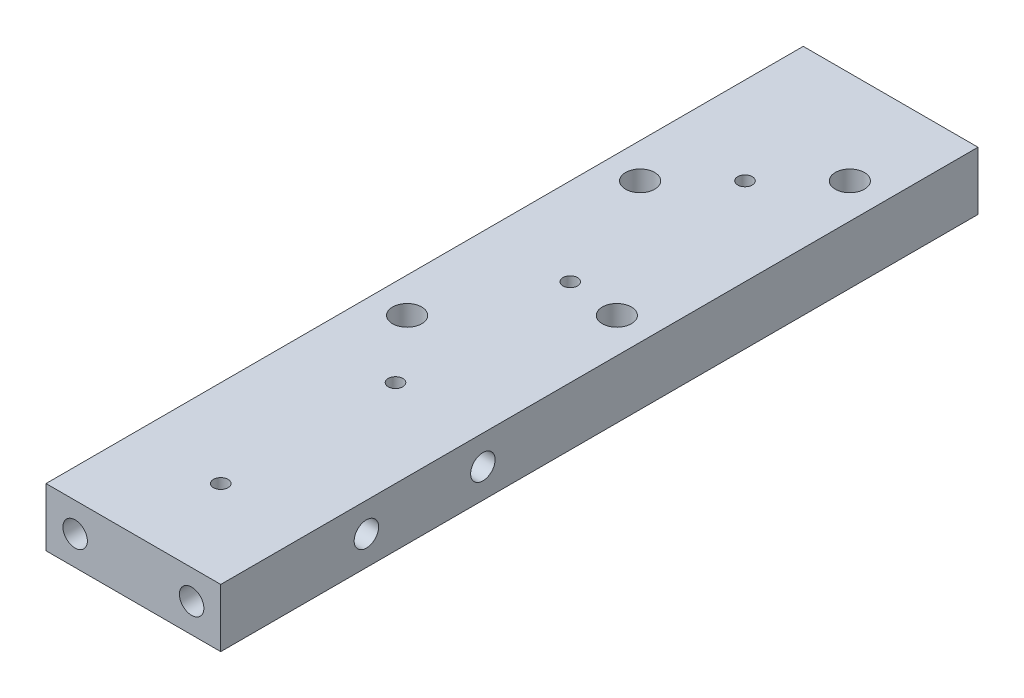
ISO-10303-21;
HEADER;
FILE_DESCRIPTION(('STEP AP214'),'2;1');
FILE_NAME('part.step','',(''),(''),'','','');
FILE_SCHEMA(('AUTOMOTIVE_DESIGN { 1 0 10303 214 1 1 1 1 }'));
ENDSEC;
DATA;
#1=APPLICATION_CONTEXT('core data for automotive mechanical design processes');
#2=APPLICATION_PROTOCOL_DEFINITION('international standard','automotive_design',2000,#1);
#3=PRODUCT_CONTEXT('',#1,'mechanical');
#4=PRODUCT('Part','Part','',(#3));
#5=PRODUCT_RELATED_PRODUCT_CATEGORY('part','',(#4));
#6=PRODUCT_DEFINITION_FORMATION('','',#4);
#7=PRODUCT_DEFINITION_CONTEXT('part definition',#1,'design');
#8=PRODUCT_DEFINITION('design','',#6,#7);
#9=PRODUCT_DEFINITION_SHAPE('','',#8);
#10=(LENGTH_UNIT() NAMED_UNIT(*) SI_UNIT(.MILLI.,.METRE.));
#11=(NAMED_UNIT(*) PLANE_ANGLE_UNIT() SI_UNIT($,.RADIAN.));
#12=(NAMED_UNIT(*) SI_UNIT($,.STERADIAN.) SOLID_ANGLE_UNIT());
#13=UNCERTAINTY_MEASURE_WITH_UNIT(LENGTH_MEASURE(1.E-05),#10,'distance_accuracy_value','');
#14=(GEOMETRIC_REPRESENTATION_CONTEXT(3) GLOBAL_UNCERTAINTY_ASSIGNED_CONTEXT((#13)) GLOBAL_UNIT_ASSIGNED_CONTEXT((#10,
#11,#12)) REPRESENTATION_CONTEXT('',''));
#15=CARTESIAN_POINT('',(0.,0.,0.));
#16=DIRECTION('',(0.,0.,1.));
#17=DIRECTION('',(1.,0.,0.));
#18=AXIS2_PLACEMENT_3D('',#15,#16,#17);
#19=CARTESIAN_POINT('',(2.59999999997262,5.,40.));
#20=DIRECTION('',(1.,0.,0.));
#21=DIRECTION('',(0.,0.,-1.));
#22=AXIS2_PLACEMENT_3D('',#19,#20,#21);
#23=CONICAL_SURFACE('',#22,2.10000000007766,1.02974425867);
#24=CARTESIAN_POINT('',(1.33819269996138,5.,40.));
#25=VERTEX_POINT('',#24);
#26=VERTEX_LOOP('',#25);
#27=FACE_BOUND('',#26,.T.);
#28=CARTESIAN_POINT('',(2.60000000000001,5.,40.));
#29=DIRECTION('',(1.,0.,0.));
#30=DIRECTION('',(0.,0.,-1.));
#31=AXIS2_PLACEMENT_3D('',#28,#29,#30);
#32=CIRCLE('',#31,2.1);
#33=CARTESIAN_POINT('',(2.60000000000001,5.,37.9));
#34=VERTEX_POINT('',#33);
#35=EDGE_CURVE('E84',#34,#34,#32,.T.);
#36=ORIENTED_EDGE('',*,*,#35,.T.);
#37=EDGE_LOOP('',(#36));
#38=FACE_BOUND('',#37,.T.);
#39=ADVANCED_FACE('F17',(#27,#38),#23,.F.);
#40=CARTESIAN_POINT('',(2.59999999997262,5.,20.));
#41=DIRECTION('',(1.,0.,0.));
#42=DIRECTION('',(0.,0.,-1.));
#43=AXIS2_PLACEMENT_3D('',#40,#41,#42);
#44=CONICAL_SURFACE('',#43,2.10000000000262,1.0297442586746);
#45=CARTESIAN_POINT('',(1.33819270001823,5.,20.));
#46=VERTEX_POINT('',#45);
#47=VERTEX_LOOP('',#46);
#48=FACE_BOUND('',#47,.T.);
#49=CARTESIAN_POINT('',(2.6,5.,20.));
#50=DIRECTION('',(1.,0.,0.));
#51=DIRECTION('',(0.,0.,-1.));
#52=AXIS2_PLACEMENT_3D('',#49,#50,#51);
#53=CIRCLE('',#52,2.1);
#54=CARTESIAN_POINT('',(2.6,5.,17.9));
#55=VERTEX_POINT('',#54);
#56=EDGE_CURVE('E86',#55,#55,#53,.T.);
#57=ORIENTED_EDGE('',*,*,#56,.T.);
#58=EDGE_LOOP('',(#57));
#59=FACE_BOUND('',#58,.T.);
#60=ADVANCED_FACE('F81',(#48,#59),#44,.F.);
#61=CARTESIAN_POINT('',(-10.0000000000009,5.,-52.6000000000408));
#62=DIRECTION('',(0.,0.,-1.));
#63=DIRECTION('',(-1.,0.,0.));
#64=AXIS2_PLACEMENT_3D('',#61,#62,#63);
#65=CONICAL_SURFACE('',#64,2.09999999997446,1.0297442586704);
#66=CARTESIAN_POINT('',(-10.0000000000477,5.,-51.3381927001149));
#67=VERTEX_POINT('',#66);
#68=VERTEX_LOOP('',#67);
#69=FACE_BOUND('',#68,.T.);
#70=CARTESIAN_POINT('',(-10.0000000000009,5.,-52.6));
#71=DIRECTION('',(0.,0.,-1.));
#72=DIRECTION('',(-1.,0.,0.));
#73=AXIS2_PLACEMENT_3D('',#70,#71,#72);
#74=CIRCLE('',#73,2.1);
#75=CARTESIAN_POINT('',(-12.1000000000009,5.,-52.6));
#76=VERTEX_POINT('',#75);
#77=EDGE_CURVE('E89',#76,#76,#74,.T.);
#78=ORIENTED_EDGE('',*,*,#77,.T.);
#79=EDGE_LOOP('',(#78));
#80=FACE_BOUND('',#79,.T.);
#81=ADVANCED_FACE('F193',(#69,#80),#65,.F.);
#82=CARTESIAN_POINT('',(9.99999999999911,5.,-52.6000000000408));
#83=DIRECTION('',(0.,0.,-1.));
#84=DIRECTION('',(-1.,0.,0.));
#85=AXIS2_PLACEMENT_3D('',#82,#83,#84);
#86=CONICAL_SURFACE('',#85,2.09999999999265,1.0297442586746);
#87=CARTESIAN_POINT('',(9.99999999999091,5.,-51.3381927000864));
#88=VERTEX_POINT('',#87);
#89=VERTEX_LOOP('',#88);
#90=FACE_BOUND('',#89,.T.);
#91=CARTESIAN_POINT('',(9.99999999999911,5.,-52.6));
#92=DIRECTION('',(0.,0.,-1.));
#93=DIRECTION('',(-1.,0.,0.));
#94=AXIS2_PLACEMENT_3D('',#91,#92,#93);
#95=CIRCLE('',#94,2.1);
#96=CARTESIAN_POINT('',(7.89999999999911,5.,-52.6));
#97=VERTEX_POINT('',#96);
#98=EDGE_CURVE('E188',#97,#97,#95,.T.);
#99=ORIENTED_EDGE('',*,*,#98,.T.);
#100=EDGE_LOOP('',(#99));
#101=FACE_BOUND('',#100,.T.);
#102=ADVANCED_FACE('F528',(#90,#101),#86,.F.);
#103=CARTESIAN_POINT('',(-2.59999999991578,5.,40.));
#104=DIRECTION('',(-1.,0.,0.));
#105=DIRECTION('',(0.,0.,1.));
#106=AXIS2_PLACEMENT_3D('',#103,#104,#105);
#107=CONICAL_SURFACE('',#106,2.09999999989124,1.02974425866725);
#108=CARTESIAN_POINT('',(-1.33819270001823,5.,40.));
#109=VERTEX_POINT('',#108);
#110=VERTEX_LOOP('',#109);
#111=FACE_BOUND('',#110,.T.);
#112=CARTESIAN_POINT('',(-2.60000000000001,5.,40.));
#113=DIRECTION('',(-1.,0.,0.));
#114=DIRECTION('',(0.,0.,1.));
#115=AXIS2_PLACEMENT_3D('',#112,#113,#114);
#116=CIRCLE('',#115,2.1);
#117=CARTESIAN_POINT('',(-2.60000000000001,5.,42.1));
#118=VERTEX_POINT('',#117);
#119=EDGE_CURVE('E185',#118,#118,#116,.T.);
#120=ORIENTED_EDGE('',*,*,#119,.T.);
#121=EDGE_LOOP('',(#120));
#122=FACE_BOUND('',#121,.T.);
#123=ADVANCED_FACE('F519',(#111,#122),#107,.F.);
#124=CARTESIAN_POINT('',(-2.59999999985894,5.,20.));
#125=DIRECTION('',(-1.,0.,0.));
#126=DIRECTION('',(0.,0.,1.));
#127=AXIS2_PLACEMENT_3D('',#124,#125,#126);
#128=CONICAL_SURFACE('',#127,2.09999999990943,1.02974425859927);
#129=CARTESIAN_POINT('',(-1.33819269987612,5.,19.9999999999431));
#130=VERTEX_POINT('',#129);
#131=VERTEX_LOOP('',#130);
#132=FACE_BOUND('',#131,.T.);
#133=CARTESIAN_POINT('',(-2.6,5.,20.));
#134=DIRECTION('',(-1.,0.,0.));
#135=DIRECTION('',(0.,0.,1.));
#136=AXIS2_PLACEMENT_3D('',#133,#134,#135);
#137=CIRCLE('',#136,2.1);
#138=CARTESIAN_POINT('',(-2.60000000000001,5.,22.1));
#139=VERTEX_POINT('',#138);
#140=EDGE_CURVE('E178',#139,#139,#137,.T.);
#141=ORIENTED_EDGE('',*,*,#140,.T.);
#142=EDGE_LOOP('',(#141));
#143=FACE_BOUND('',#142,.T.);
#144=ADVANCED_FACE('F510',(#132,#143),#128,.F.);
#145=CARTESIAN_POINT('',(9.99999999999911,5.,52.6000000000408));
#146=DIRECTION('',(0.,0.,1.));
#147=DIRECTION('',(1.,0.,0.));
#148=AXIS2_PLACEMENT_3D('',#145,#146,#147);
#149=CONICAL_SURFACE('',#148,2.09999999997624,1.02974425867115);
#150=CARTESIAN_POINT('',(10.0000000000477,5.,51.3381927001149));
#151=VERTEX_POINT('',#150);
#152=VERTEX_LOOP('',#151);
#153=FACE_BOUND('',#152,.T.);
#154=CARTESIAN_POINT('',(9.99999999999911,5.,52.6));
#155=DIRECTION('',(0.,0.,1.));
#156=DIRECTION('',(1.,0.,0.));
#157=AXIS2_PLACEMENT_3D('',#154,#155,#156);
#158=CIRCLE('',#157,2.1);
#159=CARTESIAN_POINT('',(12.0999999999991,5.,52.6));
#160=VERTEX_POINT('',#159);
#161=EDGE_CURVE('E173',#160,#160,#158,.T.);
#162=ORIENTED_EDGE('',*,*,#161,.T.);
#163=EDGE_LOOP('',(#162));
#164=FACE_BOUND('',#163,.T.);
#165=ADVANCED_FACE('F501',(#153,#164),#149,.F.);
#166=CARTESIAN_POINT('',(-10.0000000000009,5.,52.6000000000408));
#167=DIRECTION('',(0.,0.,1.));
#168=DIRECTION('',(1.,0.,0.));
#169=AXIS2_PLACEMENT_3D('',#166,#167,#168);
#170=CONICAL_SURFACE('',#169,2.09999999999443,1.0297442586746);
#171=CARTESIAN_POINT('',(-9.99999999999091,5.,51.3381927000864));
#172=VERTEX_POINT('',#171);
#173=VERTEX_LOOP('',#172);
#174=FACE_BOUND('',#173,.T.);
#175=CARTESIAN_POINT('',(-10.0000000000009,5.,52.6));
#176=DIRECTION('',(0.,0.,1.));
#177=DIRECTION('',(1.,0.,0.));
#178=AXIS2_PLACEMENT_3D('',#175,#176,#177);
#179=CIRCLE('',#178,2.1);
#180=CARTESIAN_POINT('',(-7.90000000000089,5.,52.6));
#181=VERTEX_POINT('',#180);
#182=EDGE_CURVE('E169',#181,#181,#179,.T.);
#183=ORIENTED_EDGE('',*,*,#182,.T.);
#184=EDGE_LOOP('',(#183));
#185=FACE_BOUND('',#184,.T.);
#186=ADVANCED_FACE('F492',(#174,#185),#170,.F.);
#187=CARTESIAN_POINT('',(15.,5.,40.));
#188=DIRECTION('',(1.,0.,0.));
#189=DIRECTION('',(0.,0.,-1.));
#190=AXIS2_PLACEMENT_3D('',#187,#188,#189);
#191=CYLINDRICAL_SURFACE('',#190,2.1);
#192=ORIENTED_EDGE('',*,*,#35,.F.);
#193=EDGE_LOOP('',(#192));
#194=FACE_BOUND('',#193,.T.);
#195=CARTESIAN_POINT('',(15.,5.,40.));
#196=DIRECTION('',(1.,0.,0.));
#197=DIRECTION('',(0.,0.,-1.));
#198=AXIS2_PLACEMENT_3D('',#195,#196,#197);
#199=CIRCLE('',#198,2.1);
#200=CARTESIAN_POINT('',(15.,5.,37.9));
#201=VERTEX_POINT('',#200);
#202=EDGE_CURVE('E144',#201,#201,#199,.T.);
#203=ORIENTED_EDGE('',*,*,#202,.T.);
#204=EDGE_LOOP('',(#203));
#205=FACE_BOUND('',#204,.T.);
#206=ADVANCED_FACE('F482',(#194,#205),#191,.F.);
#207=CARTESIAN_POINT('',(15.,5.,20.));
#208=DIRECTION('',(1.,0.,0.));
#209=DIRECTION('',(0.,0.,-1.));
#210=AXIS2_PLACEMENT_3D('',#207,#208,#209);
#211=CYLINDRICAL_SURFACE('',#210,2.1);
#212=ORIENTED_EDGE('',*,*,#56,.F.);
#213=EDGE_LOOP('',(#212));
#214=FACE_BOUND('',#213,.T.);
#215=CARTESIAN_POINT('',(15.,5.,20.));
#216=DIRECTION('',(1.,0.,0.));
#217=DIRECTION('',(0.,0.,-1.));
#218=AXIS2_PLACEMENT_3D('',#215,#216,#217);
#219=CIRCLE('',#218,2.1);
#220=CARTESIAN_POINT('',(15.,5.,17.9));
#221=VERTEX_POINT('',#220);
#222=EDGE_CURVE('E140',#221,#221,#219,.T.);
#223=ORIENTED_EDGE('',*,*,#222,.T.);
#224=EDGE_LOOP('',(#223));
#225=FACE_BOUND('',#224,.T.);
#226=ADVANCED_FACE('F199',(#214,#225),#211,.F.);
#227=CARTESIAN_POINT('',(-10.0000000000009,5.,-65.));
#228=DIRECTION('',(0.,0.,-1.));
#229=DIRECTION('',(-1.,0.,0.));
#230=AXIS2_PLACEMENT_3D('',#227,#228,#229);
#231=CYLINDRICAL_SURFACE('',#230,2.1);
#232=ORIENTED_EDGE('',*,*,#77,.F.);
#233=EDGE_LOOP('',(#232));
#234=FACE_BOUND('',#233,.T.);
#235=CARTESIAN_POINT('',(-10.0000000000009,5.,-65.));
#236=DIRECTION('',(0.,0.,-1.));
#237=DIRECTION('',(-1.,0.,0.));
#238=AXIS2_PLACEMENT_3D('',#235,#236,#237);
#239=CIRCLE('',#238,2.1);
#240=CARTESIAN_POINT('',(-12.1000000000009,5.,-65.));
#241=VERTEX_POINT('',#240);
#242=EDGE_CURVE('E136',#241,#241,#239,.T.);
#243=ORIENTED_EDGE('',*,*,#242,.T.);
#244=EDGE_LOOP('',(#243));
#245=FACE_BOUND('',#244,.T.);
#246=ADVANCED_FACE('F195',(#234,#245),#231,.F.);
#247=CARTESIAN_POINT('',(9.99999999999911,5.,-65.));
#248=DIRECTION('',(0.,0.,-1.));
#249=DIRECTION('',(-1.,0.,0.));
#250=AXIS2_PLACEMENT_3D('',#247,#248,#249);
#251=CYLINDRICAL_SURFACE('',#250,2.1);
#252=ORIENTED_EDGE('',*,*,#98,.F.);
#253=EDGE_LOOP('',(#252));
#254=FACE_BOUND('',#253,.T.);
#255=CARTESIAN_POINT('',(9.99999999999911,5.,-65.));
#256=DIRECTION('',(0.,0.,-1.));
#257=DIRECTION('',(-1.,0.,0.));
#258=AXIS2_PLACEMENT_3D('',#255,#256,#257);
#259=CIRCLE('',#258,2.1);
#260=CARTESIAN_POINT('',(7.89999999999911,5.,-65.));
#261=VERTEX_POINT('',#260);
#262=EDGE_CURVE('E133',#261,#261,#259,.T.);
#263=ORIENTED_EDGE('',*,*,#262,.T.);
#264=EDGE_LOOP('',(#263));
#265=FACE_BOUND('',#264,.T.);
#266=ADVANCED_FACE('F198',(#254,#265),#251,.F.);
#267=CARTESIAN_POINT('',(-15.,5.,40.));
#268=DIRECTION('',(-1.,0.,0.));
#269=DIRECTION('',(0.,0.,1.));
#270=AXIS2_PLACEMENT_3D('',#267,#268,#269);
#271=CYLINDRICAL_SURFACE('',#270,2.1);
#272=ORIENTED_EDGE('',*,*,#119,.F.);
#273=EDGE_LOOP('',(#272));
#274=FACE_BOUND('',#273,.T.);
#275=CARTESIAN_POINT('',(-15.,5.,40.));
#276=DIRECTION('',(-1.,0.,0.));
#277=DIRECTION('',(0.,0.,1.));
#278=AXIS2_PLACEMENT_3D('',#275,#276,#277);
#279=CIRCLE('',#278,2.1);
#280=CARTESIAN_POINT('',(-15.,5.,42.1));
#281=VERTEX_POINT('',#280);
#282=EDGE_CURVE('E130',#281,#281,#279,.T.);
#283=ORIENTED_EDGE('',*,*,#282,.T.);
#284=EDGE_LOOP('',(#283));
#285=FACE_BOUND('',#284,.T.);
#286=ADVANCED_FACE('F264',(#274,#285),#271,.F.);
#287=CARTESIAN_POINT('',(-15.,5.,20.));
#288=DIRECTION('',(-1.,0.,0.));
#289=DIRECTION('',(0.,0.,1.));
#290=AXIS2_PLACEMENT_3D('',#287,#288,#289);
#291=CYLINDRICAL_SURFACE('',#290,2.1);
#292=ORIENTED_EDGE('',*,*,#140,.F.);
#293=EDGE_LOOP('',(#292));
#294=FACE_BOUND('',#293,.T.);
#295=CARTESIAN_POINT('',(-15.,5.,20.));
#296=DIRECTION('',(-1.,0.,0.));
#297=DIRECTION('',(0.,0.,1.));
#298=AXIS2_PLACEMENT_3D('',#295,#296,#297);
#299=CIRCLE('',#298,2.1);
#300=CARTESIAN_POINT('',(-15.,5.,22.1));
#301=VERTEX_POINT('',#300);
#302=EDGE_CURVE('E126',#301,#301,#299,.T.);
#303=ORIENTED_EDGE('',*,*,#302,.T.);
#304=EDGE_LOOP('',(#303));
#305=FACE_BOUND('',#304,.T.);
#306=ADVANCED_FACE('F254',(#294,#305),#291,.F.);
#307=CARTESIAN_POINT('',(9.99999999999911,5.,65.));
#308=DIRECTION('',(0.,0.,1.));
#309=DIRECTION('',(1.,0.,0.));
#310=AXIS2_PLACEMENT_3D('',#307,#308,#309);
#311=CYLINDRICAL_SURFACE('',#310,2.1);
#312=ORIENTED_EDGE('',*,*,#161,.F.);
#313=EDGE_LOOP('',(#312));
#314=FACE_BOUND('',#313,.T.);
#315=CARTESIAN_POINT('',(9.99999999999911,5.,65.));
#316=DIRECTION('',(0.,0.,1.));
#317=DIRECTION('',(1.,0.,0.));
#318=AXIS2_PLACEMENT_3D('',#315,#316,#317);
#319=CIRCLE('',#318,2.1);
#320=CARTESIAN_POINT('',(12.0999999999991,5.,65.));
#321=VERTEX_POINT('',#320);
#322=EDGE_CURVE('E122',#321,#321,#319,.T.);
#323=ORIENTED_EDGE('',*,*,#322,.T.);
#324=EDGE_LOOP('',(#323));
#325=FACE_BOUND('',#324,.T.);
#326=ADVANCED_FACE('F251',(#314,#325),#311,.F.);
#327=CARTESIAN_POINT('',(-10.0000000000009,5.,65.));
#328=DIRECTION('',(0.,0.,1.));
#329=DIRECTION('',(1.,0.,0.));
#330=AXIS2_PLACEMENT_3D('',#327,#328,#329);
#331=CYLINDRICAL_SURFACE('',#330,2.1);
#332=ORIENTED_EDGE('',*,*,#182,.F.);
#333=EDGE_LOOP('',(#332));
#334=FACE_BOUND('',#333,.T.);
#335=CARTESIAN_POINT('',(-10.0000000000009,5.,65.));
#336=DIRECTION('',(0.,0.,1.));
#337=DIRECTION('',(1.,0.,0.));
#338=AXIS2_PLACEMENT_3D('',#335,#336,#337);
#339=CIRCLE('',#338,2.1);
#340=CARTESIAN_POINT('',(-7.90000000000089,5.,65.));
#341=VERTEX_POINT('',#340);
#342=EDGE_CURVE('E119',#341,#341,#339,.T.);
#343=ORIENTED_EDGE('',*,*,#342,.T.);
#344=EDGE_LOOP('',(#343));
#345=FACE_BOUND('',#344,.T.);
#346=ADVANCED_FACE('F253',(#334,#345),#331,.F.);
#347=CARTESIAN_POINT('',(0.,0.,0.));
#348=DIRECTION('',(0.,1.,0.));
#349=DIRECTION('',(0.,0.,1.));
#350=AXIS2_PLACEMENT_3D('',#347,#348,#349);
#351=PLANE('',#350);
#352=CARTESIAN_POINT('',(-9.00000000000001,0.,-31.));
#353=DIRECTION('',(0.,-1.,0.));
#354=DIRECTION('',(0.,0.,-1.));
#355=AXIS2_PLACEMENT_3D('',#352,#353,#354);
#356=CIRCLE('',#355,2.5);
#357=CARTESIAN_POINT('',(-9.00000000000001,0.,-33.5));
#358=VERTEX_POINT('',#357);
#359=EDGE_CURVE('E164',#358,#358,#356,.F.);
#360=ORIENTED_EDGE('',*,*,#359,.T.);
#361=EDGE_LOOP('',(#360));
#362=FACE_BOUND('',#361,.T.);
#363=CARTESIAN_POINT('',(9.00000000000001,0.,-9.00000000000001));
#364=DIRECTION('',(0.,-1.,0.));
#365=DIRECTION('',(0.,0.,-1.));
#366=AXIS2_PLACEMENT_3D('',#363,#364,#365);
#367=CIRCLE('',#366,2.5);
#368=CARTESIAN_POINT('',(9.00000000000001,0.,-11.5));
#369=VERTEX_POINT('',#368);
#370=EDGE_CURVE('E162',#369,#369,#367,.F.);
#371=ORIENTED_EDGE('',*,*,#370,.T.);
#372=EDGE_LOOP('',(#371));
#373=FACE_BOUND('',#372,.T.);
#374=CARTESIAN_POINT('',(-9.00000000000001,0.,8.99999999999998));
#375=DIRECTION('',(0.,-1.,0.));
#376=DIRECTION('',(0.,0.,-1.));
#377=AXIS2_PLACEMENT_3D('',#374,#375,#376);
#378=CIRCLE('',#377,2.5);
#379=CARTESIAN_POINT('',(-9.00000000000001,0.,6.49999999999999));
#380=VERTEX_POINT('',#379);
#381=EDGE_CURVE('E159',#380,#380,#378,.F.);
#382=ORIENTED_EDGE('',*,*,#381,.T.);
#383=EDGE_LOOP('',(#382));
#384=FACE_BOUND('',#383,.T.);
#385=CARTESIAN_POINT('',(0.,0.,50.));
#386=DIRECTION('',(0.,1.,0.));
#387=DIRECTION('',(0.,0.,1.));
#388=AXIS2_PLACEMENT_3D('',#385,#386,#387);
#389=CIRCLE('',#388,1.24999999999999);
#390=CARTESIAN_POINT('',(0.,0.,51.25));
#391=VERTEX_POINT('',#390);
#392=EDGE_CURVE('E156',#391,#391,#389,.T.);
#393=ORIENTED_EDGE('',*,*,#392,.T.);
#394=EDGE_LOOP('',(#393));
#395=FACE_BOUND('',#394,.T.);
#396=CARTESIAN_POINT('',(0.,0.,20.));
#397=DIRECTION('',(0.,1.,0.));
#398=DIRECTION('',(0.,0.,1.));
#399=AXIS2_PLACEMENT_3D('',#396,#397,#398);
#400=CIRCLE('',#399,1.24999999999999);
#401=CARTESIAN_POINT('',(0.,0.,21.25));
#402=VERTEX_POINT('',#401);
#403=EDGE_CURVE('E153',#402,#402,#400,.T.);
#404=ORIENTED_EDGE('',*,*,#403,.T.);
#405=EDGE_LOOP('',(#404));
#406=FACE_BOUND('',#405,.T.);
#407=CARTESIAN_POINT('',(0.,0.,-10.));
#408=DIRECTION('',(0.,1.,0.));
#409=DIRECTION('',(0.,0.,1.));
#410=AXIS2_PLACEMENT_3D('',#407,#408,#409);
#411=CIRCLE('',#410,1.24999999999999);
#412=CARTESIAN_POINT('',(0.,0.,-8.75000000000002));
#413=VERTEX_POINT('',#412);
#414=EDGE_CURVE('E150',#413,#413,#411,.T.);
#415=ORIENTED_EDGE('',*,*,#414,.T.);
#416=EDGE_LOOP('',(#415));
#417=FACE_BOUND('',#416,.T.);
#418=CARTESIAN_POINT('',(0.,0.,-40.));
#419=DIRECTION('',(0.,1.,0.));
#420=DIRECTION('',(0.,0.,1.));
#421=AXIS2_PLACEMENT_3D('',#418,#419,#420);
#422=CIRCLE('',#421,1.24999999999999);
#423=CARTESIAN_POINT('',(0.,0.,-38.75));
#424=VERTEX_POINT('',#423);
#425=EDGE_CURVE('E147',#424,#424,#422,.T.);
#426=ORIENTED_EDGE('',*,*,#425,.T.);
#427=EDGE_LOOP('',(#426));
#428=FACE_BOUND('',#427,.T.);
#429=DIRECTION('',(-1.,0.,0.));
#430=VECTOR('',#429,1.);
#431=CARTESIAN_POINT('',(-15.,0.,65.));
#432=LINE('',#431,#430);
#433=CARTESIAN_POINT('',(15.,0.,65.));
#434=VERTEX_POINT('',#433);
#435=CARTESIAN_POINT('',(-15.,0.,65.));
#436=VERTEX_POINT('',#435);
#437=EDGE_CURVE('E118',#434,#436,#432,.T.);
#438=ORIENTED_EDGE('',*,*,#437,.T.);
#439=DIRECTION('',(0.,0.,-1.));
#440=VECTOR('',#439,1.);
#441=CARTESIAN_POINT('',(-15.,0.,-65.));
#442=LINE('',#441,#440);
#443=CARTESIAN_POINT('',(-15.,0.,-65.));
#444=VERTEX_POINT('',#443);
#445=EDGE_CURVE('E125',#436,#444,#442,.T.);
#446=ORIENTED_EDGE('',*,*,#445,.T.);
#447=DIRECTION('',(1.,0.,0.));
#448=VECTOR('',#447,1.);
#449=CARTESIAN_POINT('',(-15.,0.,-65.));
#450=LINE('',#449,#448);
#451=CARTESIAN_POINT('',(15.,0.,-65.));
#452=VERTEX_POINT('',#451);
#453=EDGE_CURVE('E139',#444,#452,#450,.T.);
#454=ORIENTED_EDGE('',*,*,#453,.T.);
#455=DIRECTION('',(0.,0.,1.));
#456=VECTOR('',#455,1.);
#457=CARTESIAN_POINT('',(15.,0.,-65.));
#458=LINE('',#457,#456);
#459=EDGE_CURVE('E143',#452,#434,#458,.T.);
#460=ORIENTED_EDGE('',*,*,#459,.T.);
#461=EDGE_LOOP('',(#438,#446,#454,#460));
#462=FACE_BOUND('',#461,.T.);
#463=CARTESIAN_POINT('',(9.00000000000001,0.,-49.));
#464=DIRECTION('',(0.,-1.,0.));
#465=DIRECTION('',(0.,0.,-1.));
#466=AXIS2_PLACEMENT_3D('',#463,#464,#465);
#467=CIRCLE('',#466,2.5);
#468=CARTESIAN_POINT('',(9.00000000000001,0.,-51.5));
#469=VERTEX_POINT('',#468);
#470=EDGE_CURVE('E20',#469,#469,#467,.F.);
#471=ORIENTED_EDGE('',*,*,#470,.T.);
#472=EDGE_LOOP('',(#471));
#473=FACE_BOUND('',#472,.T.);
#474=ADVANCED_FACE('F238',(#362,#373,#384,#395,#406,#417,#428,#462,#473),#351,.F.);
#475=CARTESIAN_POINT('',(9.00000000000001,0.,-49.));
#476=DIRECTION('',(0.,-1.,0.));
#477=DIRECTION('',(0.,0.,-1.));
#478=AXIS2_PLACEMENT_3D('',#475,#476,#477);
#479=CYLINDRICAL_SURFACE('',#478,2.5);
#480=CARTESIAN_POINT('',(9.00000000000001,10.,-49.));
#481=DIRECTION('',(0.,-1.,0.));
#482=DIRECTION('',(0.,0.,-1.));
#483=AXIS2_PLACEMENT_3D('',#480,#481,#482);
#484=CIRCLE('',#483,2.5);
#485=CARTESIAN_POINT('',(9.00000000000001,10.,-51.5));
#486=VERTEX_POINT('',#485);
#487=EDGE_CURVE('E115',#486,#486,#484,.T.);
#488=ORIENTED_EDGE('',*,*,#487,.F.);
#489=EDGE_LOOP('',(#488));
#490=FACE_BOUND('',#489,.T.);
#491=ORIENTED_EDGE('',*,*,#470,.F.);
#492=EDGE_LOOP('',(#491));
#493=FACE_BOUND('',#492,.T.);
#494=ADVANCED_FACE('F304',(#490,#493),#479,.F.);
#495=CARTESIAN_POINT('',(-9.00000000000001,0.,-31.));
#496=DIRECTION('',(0.,-1.,0.));
#497=DIRECTION('',(0.,0.,-1.));
#498=AXIS2_PLACEMENT_3D('',#495,#496,#497);
#499=CYLINDRICAL_SURFACE('',#498,2.5);
#500=CARTESIAN_POINT('',(-9.00000000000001,10.,-31.));
#501=DIRECTION('',(0.,-1.,0.));
#502=DIRECTION('',(0.,0.,-1.));
#503=AXIS2_PLACEMENT_3D('',#500,#501,#502);
#504=CIRCLE('',#503,2.5);
#505=CARTESIAN_POINT('',(-9.00000000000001,10.,-33.5));
#506=VERTEX_POINT('',#505);
#507=EDGE_CURVE('E112',#506,#506,#504,.T.);
#508=ORIENTED_EDGE('',*,*,#507,.F.);
#509=EDGE_LOOP('',(#508));
#510=FACE_BOUND('',#509,.T.);
#511=ORIENTED_EDGE('',*,*,#359,.F.);
#512=EDGE_LOOP('',(#511));
#513=FACE_BOUND('',#512,.T.);
#514=ADVANCED_FACE('F300',(#510,#513),#499,.F.);
#515=CARTESIAN_POINT('',(9.00000000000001,0.,-9.00000000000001));
#516=DIRECTION('',(0.,-1.,0.));
#517=DIRECTION('',(0.,0.,-1.));
#518=AXIS2_PLACEMENT_3D('',#515,#516,#517);
#519=CYLINDRICAL_SURFACE('',#518,2.5);
#520=CARTESIAN_POINT('',(9.00000000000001,10.,-9.00000000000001));
#521=DIRECTION('',(0.,-1.,0.));
#522=DIRECTION('',(0.,0.,-1.));
#523=AXIS2_PLACEMENT_3D('',#520,#521,#522);
#524=CIRCLE('',#523,2.5);
#525=CARTESIAN_POINT('',(9.00000000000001,10.,-11.5));
#526=VERTEX_POINT('',#525);
#527=EDGE_CURVE('E109',#526,#526,#524,.T.);
#528=ORIENTED_EDGE('',*,*,#527,.F.);
#529=EDGE_LOOP('',(#528));
#530=FACE_BOUND('',#529,.T.);
#531=ORIENTED_EDGE('',*,*,#370,.F.);
#532=EDGE_LOOP('',(#531));
#533=FACE_BOUND('',#532,.T.);
#534=ADVANCED_FACE('F296',(#530,#533),#519,.F.);
#535=CARTESIAN_POINT('',(-9.00000000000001,0.,8.99999999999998));
#536=DIRECTION('',(0.,-1.,0.));
#537=DIRECTION('',(0.,0.,-1.));
#538=AXIS2_PLACEMENT_3D('',#535,#536,#537);
#539=CYLINDRICAL_SURFACE('',#538,2.5);
#540=CARTESIAN_POINT('',(-9.00000000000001,10.,8.99999999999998));
#541=DIRECTION('',(0.,-1.,0.));
#542=DIRECTION('',(0.,0.,-1.));
#543=AXIS2_PLACEMENT_3D('',#540,#541,#542);
#544=CIRCLE('',#543,2.5);
#545=CARTESIAN_POINT('',(-9.00000000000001,10.,6.49999999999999));
#546=VERTEX_POINT('',#545);
#547=EDGE_CURVE('E106',#546,#546,#544,.T.);
#548=ORIENTED_EDGE('',*,*,#547,.F.);
#549=EDGE_LOOP('',(#548));
#550=FACE_BOUND('',#549,.T.);
#551=ORIENTED_EDGE('',*,*,#381,.F.);
#552=EDGE_LOOP('',(#551));
#553=FACE_BOUND('',#552,.T.);
#554=ADVANCED_FACE('F292',(#550,#553),#539,.F.);
#555=CARTESIAN_POINT('',(0.,10.,50.));
#556=DIRECTION('',(0.,1.,0.));
#557=DIRECTION('',(0.,0.,1.));
#558=AXIS2_PLACEMENT_3D('',#555,#556,#557);
#559=CYLINDRICAL_SURFACE('',#558,1.24999999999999);
#560=CARTESIAN_POINT('',(0.,10.,50.));
#561=DIRECTION('',(0.,1.,0.));
#562=DIRECTION('',(0.,0.,1.));
#563=AXIS2_PLACEMENT_3D('',#560,#561,#562);
#564=CIRCLE('',#563,1.24999999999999);
#565=CARTESIAN_POINT('',(0.,10.,51.25));
#566=VERTEX_POINT('',#565);
#567=EDGE_CURVE('E103',#566,#566,#564,.F.);
#568=ORIENTED_EDGE('',*,*,#567,.F.);
#569=EDGE_LOOP('',(#568));
#570=FACE_BOUND('',#569,.T.);
#571=ORIENTED_EDGE('',*,*,#392,.F.);
#572=EDGE_LOOP('',(#571));
#573=FACE_BOUND('',#572,.T.);
#574=ADVANCED_FACE('F288',(#570,#573),#559,.F.);
#575=CARTESIAN_POINT('',(0.,10.,20.));
#576=DIRECTION('',(0.,1.,0.));
#577=DIRECTION('',(0.,0.,1.));
#578=AXIS2_PLACEMENT_3D('',#575,#576,#577);
#579=CYLINDRICAL_SURFACE('',#578,1.24999999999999);
#580=CARTESIAN_POINT('',(0.,10.,20.));
#581=DIRECTION('',(0.,1.,0.));
#582=DIRECTION('',(0.,0.,1.));
#583=AXIS2_PLACEMENT_3D('',#580,#581,#582);
#584=CIRCLE('',#583,1.24999999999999);
#585=CARTESIAN_POINT('',(0.,10.,21.25));
#586=VERTEX_POINT('',#585);
#587=EDGE_CURVE('E100',#586,#586,#584,.F.);
#588=ORIENTED_EDGE('',*,*,#587,.F.);
#589=EDGE_LOOP('',(#588));
#590=FACE_BOUND('',#589,.T.);
#591=ORIENTED_EDGE('',*,*,#403,.F.);
#592=EDGE_LOOP('',(#591));
#593=FACE_BOUND('',#592,.T.);
#594=ADVANCED_FACE('F284',(#590,#593),#579,.F.);
#595=CARTESIAN_POINT('',(0.,10.,-10.));
#596=DIRECTION('',(0.,1.,0.));
#597=DIRECTION('',(0.,0.,1.));
#598=AXIS2_PLACEMENT_3D('',#595,#596,#597);
#599=CYLINDRICAL_SURFACE('',#598,1.24999999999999);
#600=CARTESIAN_POINT('',(0.,10.,-10.));
#601=DIRECTION('',(0.,1.,0.));
#602=DIRECTION('',(0.,0.,1.));
#603=AXIS2_PLACEMENT_3D('',#600,#601,#602);
#604=CIRCLE('',#603,1.24999999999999);
#605=CARTESIAN_POINT('',(0.,10.,-8.75000000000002));
#606=VERTEX_POINT('',#605);
#607=EDGE_CURVE('E97',#606,#606,#604,.F.);
#608=ORIENTED_EDGE('',*,*,#607,.F.);
#609=EDGE_LOOP('',(#608));
#610=FACE_BOUND('',#609,.T.);
#611=ORIENTED_EDGE('',*,*,#414,.F.);
#612=EDGE_LOOP('',(#611));
#613=FACE_BOUND('',#612,.T.);
#614=ADVANCED_FACE('F280',(#610,#613),#599,.F.);
#615=CARTESIAN_POINT('',(0.,10.,-40.));
#616=DIRECTION('',(0.,1.,0.));
#617=DIRECTION('',(0.,0.,1.));
#618=AXIS2_PLACEMENT_3D('',#615,#616,#617);
#619=CYLINDRICAL_SURFACE('',#618,1.24999999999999);
#620=CARTESIAN_POINT('',(0.,10.,-40.));
#621=DIRECTION('',(0.,1.,0.));
#622=DIRECTION('',(0.,0.,1.));
#623=AXIS2_PLACEMENT_3D('',#620,#621,#622);
#624=CIRCLE('',#623,1.24999999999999);
#625=CARTESIAN_POINT('',(0.,10.,-38.75));
#626=VERTEX_POINT('',#625);
#627=EDGE_CURVE('E93',#626,#626,#624,.F.);
#628=ORIENTED_EDGE('',*,*,#627,.F.);
#629=EDGE_LOOP('',(#628));
#630=FACE_BOUND('',#629,.T.);
#631=ORIENTED_EDGE('',*,*,#425,.F.);
#632=EDGE_LOOP('',(#631));
#633=FACE_BOUND('',#632,.T.);
#634=ADVANCED_FACE('F277',(#630,#633),#619,.F.);
#635=CARTESIAN_POINT('',(15.,10.,-65.));
#636=DIRECTION('',(-1.,0.,0.));
#637=DIRECTION('',(0.,0.,1.));
#638=AXIS2_PLACEMENT_3D('',#635,#636,#637);
#639=PLANE('',#638);
#640=DIRECTION('',(0.,1.,0.));
#641=VECTOR('',#640,1.);
#642=CARTESIAN_POINT('',(15.,10.,-65.));
#643=LINE('',#642,#641);
#644=CARTESIAN_POINT('',(15.,10.,-65.));
#645=VERTEX_POINT('',#644);
#646=EDGE_CURVE('E235',#452,#645,#643,.T.);
#647=ORIENTED_EDGE('',*,*,#646,.T.);
#648=DIRECTION('',(0.,0.,1.));
#649=VECTOR('',#648,1.);
#650=CARTESIAN_POINT('',(15.,10.,0.));
#651=LINE('',#650,#649);
#652=CARTESIAN_POINT('',(15.,10.,65.));
#653=VERTEX_POINT('',#652);
#654=EDGE_CURVE('E96',#653,#645,#651,.F.);
#655=ORIENTED_EDGE('',*,*,#654,.F.);
#656=DIRECTION('',(0.,1.,0.));
#657=VECTOR('',#656,1.);
#658=CARTESIAN_POINT('',(15.,10.,65.));
#659=LINE('',#658,#657);
#660=EDGE_CURVE('E230',#653,#434,#659,.F.);
#661=ORIENTED_EDGE('',*,*,#660,.T.);
#662=ORIENTED_EDGE('',*,*,#459,.F.);
#663=EDGE_LOOP('',(#647,#655,#661,#662));
#664=FACE_BOUND('',#663,.T.);
#665=ORIENTED_EDGE('',*,*,#222,.F.);
#666=EDGE_LOOP('',(#665));
#667=FACE_BOUND('',#666,.T.);
#668=ORIENTED_EDGE('',*,*,#202,.F.);
#669=EDGE_LOOP('',(#668));
#670=FACE_BOUND('',#669,.T.);
#671=ADVANCED_FACE('F207',(#664,#667,#670),#639,.F.);
#672=CARTESIAN_POINT('',(-15.,10.,-65.));
#673=DIRECTION('',(0.,0.,1.));
#674=DIRECTION('',(1.,0.,0.));
#675=AXIS2_PLACEMENT_3D('',#672,#673,#674);
#676=PLANE('',#675);
#677=ORIENTED_EDGE('',*,*,#262,.F.);
#678=EDGE_LOOP('',(#677));
#679=FACE_BOUND('',#678,.T.);
#680=ORIENTED_EDGE('',*,*,#242,.F.);
#681=EDGE_LOOP('',(#680));
#682=FACE_BOUND('',#681,.T.);
#683=DIRECTION('',(0.,1.,0.));
#684=VECTOR('',#683,1.);
#685=CARTESIAN_POINT('',(-15.,10.,-65.));
#686=LINE('',#685,#684);
#687=CARTESIAN_POINT('',(-15.,10.,-65.));
#688=VERTEX_POINT('',#687);
#689=EDGE_CURVE('E129',#444,#688,#686,.T.);
#690=ORIENTED_EDGE('',*,*,#689,.T.);
#691=DIRECTION('',(1.,0.,0.));
#692=VECTOR('',#691,1.);
#693=CARTESIAN_POINT('',(0.,10.,-65.));
#694=LINE('',#693,#692);
#695=EDGE_CURVE('E214',#645,#688,#694,.F.);
#696=ORIENTED_EDGE('',*,*,#695,.F.);
#697=ORIENTED_EDGE('',*,*,#646,.F.);
#698=ORIENTED_EDGE('',*,*,#453,.F.);
#699=EDGE_LOOP('',(#690,#696,#697,#698));
#700=FACE_BOUND('',#699,.T.);
#701=ADVANCED_FACE('F203',(#679,#682,#700),#676,.F.);
#702=CARTESIAN_POINT('',(-15.,10.,-65.));
#703=DIRECTION('',(1.,0.,0.));
#704=DIRECTION('',(0.,0.,-1.));
#705=AXIS2_PLACEMENT_3D('',#702,#703,#704);
#706=PLANE('',#705);
#707=DIRECTION('',(0.,1.,0.));
#708=VECTOR('',#707,1.);
#709=CARTESIAN_POINT('',(-15.,10.,65.));
#710=LINE('',#709,#708);
#711=CARTESIAN_POINT('',(-15.,10.,65.));
#712=VERTEX_POINT('',#711);
#713=EDGE_CURVE('E35',#436,#712,#710,.T.);
#714=ORIENTED_EDGE('',*,*,#713,.T.);
#715=DIRECTION('',(0.,0.,1.));
#716=VECTOR('',#715,1.);
#717=CARTESIAN_POINT('',(-15.,10.,0.));
#718=LINE('',#717,#716);
#719=EDGE_CURVE('E26',#688,#712,#718,.T.);
#720=ORIENTED_EDGE('',*,*,#719,.F.);
#721=ORIENTED_EDGE('',*,*,#689,.F.);
#722=ORIENTED_EDGE('',*,*,#445,.F.);
#723=EDGE_LOOP('',(#714,#720,#721,#722));
#724=FACE_BOUND('',#723,.T.);
#725=ORIENTED_EDGE('',*,*,#302,.F.);
#726=EDGE_LOOP('',(#725));
#727=FACE_BOUND('',#726,.T.);
#728=ORIENTED_EDGE('',*,*,#282,.F.);
#729=EDGE_LOOP('',(#728));
#730=FACE_BOUND('',#729,.T.);
#731=ADVANCED_FACE('F206',(#724,#727,#730),#706,.F.);
#732=CARTESIAN_POINT('',(-15.,10.,65.));
#733=DIRECTION('',(0.,0.,-1.));
#734=DIRECTION('',(-1.,0.,0.));
#735=AXIS2_PLACEMENT_3D('',#732,#733,#734);
#736=PLANE('',#735);
#737=ORIENTED_EDGE('',*,*,#660,.F.);
#738=DIRECTION('',(1.,0.,0.));
#739=VECTOR('',#738,1.);
#740=CARTESIAN_POINT('',(0.,10.,65.));
#741=LINE('',#740,#739);
#742=EDGE_CURVE('E11',#712,#653,#741,.T.);
#743=ORIENTED_EDGE('',*,*,#742,.F.);
#744=ORIENTED_EDGE('',*,*,#713,.F.);
#745=ORIENTED_EDGE('',*,*,#437,.F.);
#746=EDGE_LOOP('',(#737,#743,#744,#745));
#747=FACE_BOUND('',#746,.T.);
#748=ORIENTED_EDGE('',*,*,#342,.F.);
#749=EDGE_LOOP('',(#748));
#750=FACE_BOUND('',#749,.T.);
#751=ORIENTED_EDGE('',*,*,#322,.F.);
#752=EDGE_LOOP('',(#751));
#753=FACE_BOUND('',#752,.T.);
#754=ADVANCED_FACE('F243',(#747,#750,#753),#736,.F.);
#755=CARTESIAN_POINT('',(0.,10.,0.));
#756=DIRECTION('',(0.,1.,0.));
#757=DIRECTION('',(0.,0.,1.));
#758=AXIS2_PLACEMENT_3D('',#755,#756,#757);
#759=PLANE('',#758);
#760=ORIENTED_EDGE('',*,*,#719,.T.);
#761=ORIENTED_EDGE('',*,*,#742,.T.);
#762=ORIENTED_EDGE('',*,*,#654,.T.);
#763=ORIENTED_EDGE('',*,*,#695,.T.);
#764=EDGE_LOOP('',(#760,#761,#762,#763));
#765=FACE_BOUND('',#764,.T.);
#766=ORIENTED_EDGE('',*,*,#627,.T.);
#767=EDGE_LOOP('',(#766));
#768=FACE_BOUND('',#767,.T.);
#769=ORIENTED_EDGE('',*,*,#607,.T.);
#770=EDGE_LOOP('',(#769));
#771=FACE_BOUND('',#770,.T.);
#772=ORIENTED_EDGE('',*,*,#587,.T.);
#773=EDGE_LOOP('',(#772));
#774=FACE_BOUND('',#773,.T.);
#775=ORIENTED_EDGE('',*,*,#567,.T.);
#776=EDGE_LOOP('',(#775));
#777=FACE_BOUND('',#776,.T.);
#778=ORIENTED_EDGE('',*,*,#547,.T.);
#779=EDGE_LOOP('',(#778));
#780=FACE_BOUND('',#779,.T.);
#781=ORIENTED_EDGE('',*,*,#527,.T.);
#782=EDGE_LOOP('',(#781));
#783=FACE_BOUND('',#782,.T.);
#784=ORIENTED_EDGE('',*,*,#507,.T.);
#785=EDGE_LOOP('',(#784));
#786=FACE_BOUND('',#785,.T.);
#787=ORIENTED_EDGE('',*,*,#487,.T.);
#788=EDGE_LOOP('',(#787));
#789=FACE_BOUND('',#788,.T.);
#790=ADVANCED_FACE('F223',(#765,#768,#771,#774,#777,#780,#783,#786,#789),#759,.T.);
#791=CLOSED_SHELL('',(#39,#60,#81,#102,#123,#144,#165,#186,#206,#226,#246,#266,#286,#306,#326,
#346,#474,#494,#514,#534,#554,#574,#594,#614,#634,#671,#701,#731,#754,#790));
#792=MANIFOLD_SOLID_BREP('B1',#791);
#793=ADVANCED_BREP_SHAPE_REPRESENTATION('',(#18,#792),#14);
#794=SHAPE_DEFINITION_REPRESENTATION(#9,#793);
ENDSEC;
END-ISO-10303-21;
